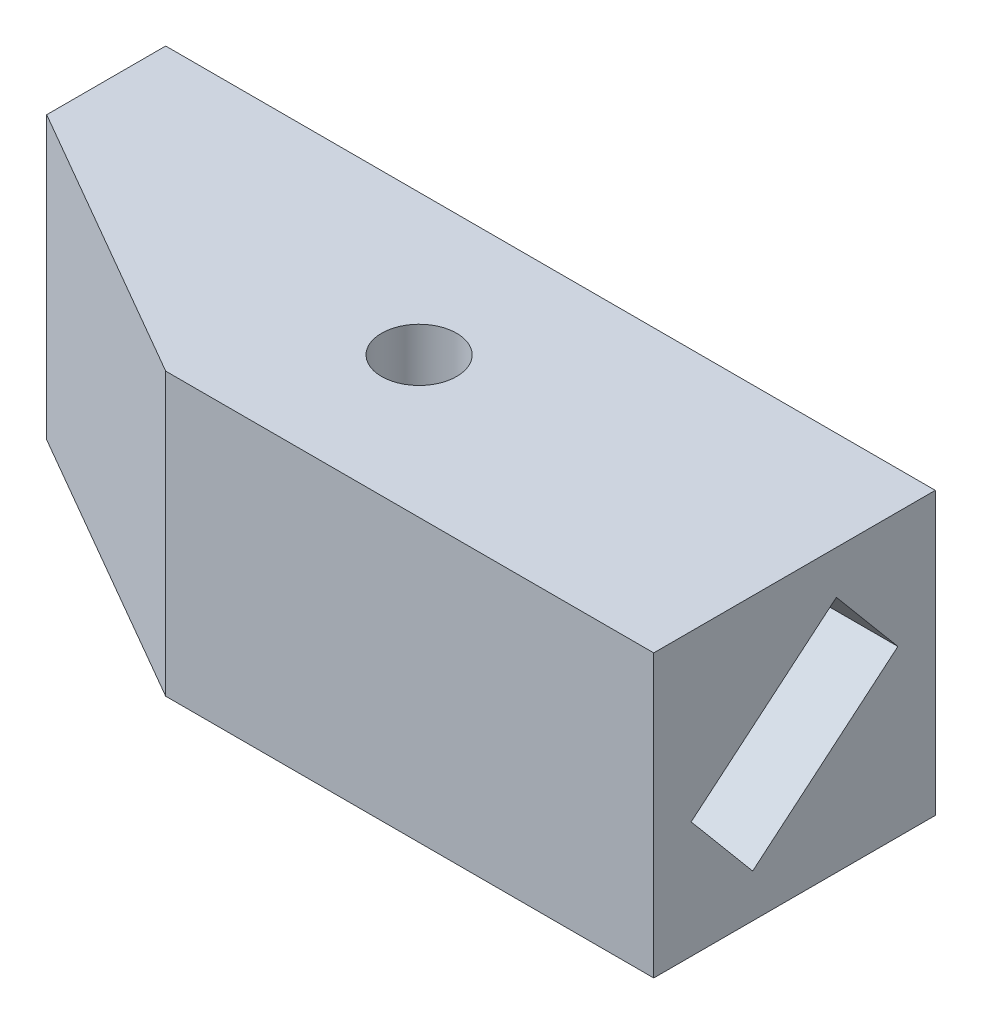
ISO-10303-21;
HEADER;
FILE_DESCRIPTION(('STEP AP214'),'2;1');
FILE_NAME('part.step','',(''),(''),'','','');
FILE_SCHEMA(('AUTOMOTIVE_DESIGN { 1 0 10303 214 1 1 1 1 }'));
ENDSEC;
DATA;
#1=APPLICATION_CONTEXT('core data for automotive mechanical design processes');
#2=APPLICATION_PROTOCOL_DEFINITION('international standard','automotive_design',2000,#1);
#3=PRODUCT_CONTEXT('',#1,'mechanical');
#4=PRODUCT('Part','Part','',(#3));
#5=PRODUCT_RELATED_PRODUCT_CATEGORY('part','',(#4));
#6=PRODUCT_DEFINITION_FORMATION('','',#4);
#7=PRODUCT_DEFINITION_CONTEXT('part definition',#1,'design');
#8=PRODUCT_DEFINITION('design','',#6,#7);
#9=PRODUCT_DEFINITION_SHAPE('','',#8);
#10=(LENGTH_UNIT() NAMED_UNIT(*) SI_UNIT(.MILLI.,.METRE.));
#11=(NAMED_UNIT(*) PLANE_ANGLE_UNIT() SI_UNIT($,.RADIAN.));
#12=(NAMED_UNIT(*) SI_UNIT($,.STERADIAN.) SOLID_ANGLE_UNIT());
#13=UNCERTAINTY_MEASURE_WITH_UNIT(LENGTH_MEASURE(1.E-05),#10,'distance_accuracy_value','');
#14=(GEOMETRIC_REPRESENTATION_CONTEXT(3) GLOBAL_UNCERTAINTY_ASSIGNED_CONTEXT((#13)) GLOBAL_UNIT_ASSIGNED_CONTEXT((#10,
#11,#12)) REPRESENTATION_CONTEXT('',''));
#15=CARTESIAN_POINT('',(0.,0.,0.));
#16=DIRECTION('',(0.,0.,1.));
#17=DIRECTION('',(1.,0.,0.));
#18=AXIS2_PLACEMENT_3D('',#15,#16,#17);
#19=CARTESIAN_POINT('',(20.,30.,15.));
#20=DIRECTION('',(-1.,0.,0.));
#21=DIRECTION('',(0.,0.,1.));
#22=AXIS2_PLACEMENT_3D('',#19,#20,#21);
#23=PLANE('',#22);
#24=DIRECTION('',(0.,-0.766044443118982,-0.642787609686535));
#25=VECTOR('',#24,1.);
#26=CARTESIAN_POINT('',(20.,4.60101848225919,4.45883206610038));
#27=LINE('',#26,#25);
#28=CARTESIAN_POINT('',(20.,12.4146718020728,11.015265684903));
#29=VERTEX_POINT('',#28);
#30=CARTESIAN_POINT('',(20.,4.60101848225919,4.45883206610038));
#31=VERTEX_POINT('',#30);
#32=EDGE_CURVE('E145',#29,#31,#27,.T.);
#33=ORIENTED_EDGE('',*,*,#32,.F.);
#34=DIRECTION('',(0.,-0.642787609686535,0.766044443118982));
#35=VECTOR('',#34,1.);
#36=CARTESIAN_POINT('',(20.,25.3989815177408,-4.45883206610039));
#37=LINE('',#36,#35);
#38=CARTESIAN_POINT('',(20.,25.3989815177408,-4.45883206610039));
#39=VERTEX_POINT('',#38);
#40=EDGE_CURVE('E127',#39,#29,#37,.T.);
#41=ORIENTED_EDGE('',*,*,#40,.F.);
#42=DIRECTION('',(0.,0.766044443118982,0.642787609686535));
#43=VECTOR('',#42,1.);
#44=CARTESIAN_POINT('',(20.,17.5853281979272,-11.015265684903));
#45=LINE('',#44,#43);
#46=CARTESIAN_POINT('',(20.,17.5853281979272,-11.015265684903));
#47=VERTEX_POINT('',#46);
#48=EDGE_CURVE('E134',#47,#39,#45,.T.);
#49=ORIENTED_EDGE('',*,*,#48,.F.);
#50=DIRECTION('',(0.,0.642787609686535,-0.766044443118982));
#51=VECTOR('',#50,1.);
#52=CARTESIAN_POINT('',(20.,17.5853281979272,-11.015265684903));
#53=LINE('',#52,#51);
#54=EDGE_CURVE('E148',#31,#47,#53,.T.);
#55=ORIENTED_EDGE('',*,*,#54,.F.);
#56=EDGE_LOOP('',(#33,#41,#49,#55));
#57=FACE_BOUND('',#56,.T.);
#58=DIRECTION('',(0.,0.,-1.));
#59=VECTOR('',#58,1.);
#60=CARTESIAN_POINT('',(20.,0.,15.));
#61=LINE('',#60,#59);
#62=CARTESIAN_POINT('',(20.,0.,15.));
#63=VERTEX_POINT('',#62);
#64=CARTESIAN_POINT('',(20.,0.,-15.));
#65=VERTEX_POINT('',#64);
#66=EDGE_CURVE('E165',#63,#65,#61,.T.);
#67=ORIENTED_EDGE('',*,*,#66,.T.);
#68=DIRECTION('',(0.,-1.,0.));
#69=VECTOR('',#68,1.);
#70=CARTESIAN_POINT('',(20.,30.,-15.));
#71=LINE('',#70,#69);
#72=CARTESIAN_POINT('',(20.,30.,-15.));
#73=VERTEX_POINT('',#72);
#74=EDGE_CURVE('E178',#73,#65,#71,.T.);
#75=ORIENTED_EDGE('',*,*,#74,.F.);
#76=DIRECTION('',(0.,0.,-1.));
#77=VECTOR('',#76,1.);
#78=CARTESIAN_POINT('',(20.,30.,15.));
#79=LINE('',#78,#77);
#80=CARTESIAN_POINT('',(20.,30.,15.));
#81=VERTEX_POINT('',#80);
#82=EDGE_CURVE('E117',#81,#73,#79,.T.);
#83=ORIENTED_EDGE('',*,*,#82,.F.);
#84=DIRECTION('',(0.,-1.,0.));
#85=VECTOR('',#84,1.);
#86=CARTESIAN_POINT('',(20.,30.,15.));
#87=LINE('',#86,#85);
#88=EDGE_CURVE('E171',#81,#63,#87,.T.);
#89=ORIENTED_EDGE('',*,*,#88,.T.);
#90=EDGE_LOOP('',(#67,#75,#83,#89));
#91=FACE_BOUND('',#90,.T.);
#92=ADVANCED_FACE('F34',(#57,#91),#23,.F.);
#93=CARTESIAN_POINT('',(-20.,30.,-15.));
#94=DIRECTION('',(0.,0.,1.));
#95=DIRECTION('',(1.,0.,0.));
#96=AXIS2_PLACEMENT_3D('',#93,#94,#95);
#97=PLANE('',#96);
#98=DIRECTION('',(-1.,0.,0.));
#99=VECTOR('',#98,1.);
#100=CARTESIAN_POINT('',(-20.,0.,-15.));
#101=LINE('',#100,#99);
#102=CARTESIAN_POINT('',(-62.,0.,-15.));
#103=VERTEX_POINT('',#102);
#104=EDGE_CURVE('E124',#65,#103,#101,.T.);
#105=ORIENTED_EDGE('',*,*,#104,.T.);
#106=DIRECTION('',(0.,-1.,0.));
#107=VECTOR('',#106,1.);
#108=CARTESIAN_POINT('',(-62.,0.,-15.));
#109=LINE('',#108,#107);
#110=CARTESIAN_POINT('',(-62.,30.,-15.));
#111=VERTEX_POINT('',#110);
#112=EDGE_CURVE('E108',#111,#103,#109,.T.);
#113=ORIENTED_EDGE('',*,*,#112,.F.);
#114=DIRECTION('',(-1.,0.,0.));
#115=VECTOR('',#114,1.);
#116=CARTESIAN_POINT('',(-20.,30.,-15.));
#117=LINE('',#116,#115);
#118=EDGE_CURVE('E114',#73,#111,#117,.T.);
#119=ORIENTED_EDGE('',*,*,#118,.F.);
#120=ORIENTED_EDGE('',*,*,#74,.T.);
#121=EDGE_LOOP('',(#105,#113,#119,#120));
#122=FACE_BOUND('',#121,.T.);
#123=ADVANCED_FACE('F123',(#122),#97,.F.);
#124=CARTESIAN_POINT('',(-20.,30.,15.));
#125=DIRECTION('',(0.,0.,-1.));
#126=DIRECTION('',(-1.,0.,0.));
#127=AXIS2_PLACEMENT_3D('',#124,#125,#126);
#128=PLANE('',#127);
#129=DIRECTION('',(1.,0.,0.));
#130=VECTOR('',#129,1.);
#131=CARTESIAN_POINT('',(-35.,30.,15.));
#132=LINE('',#131,#130);
#133=CARTESIAN_POINT('',(-31.9999999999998,30.,15.));
#134=VERTEX_POINT('',#133);
#135=EDGE_CURVE('E121',#134,#81,#132,.T.);
#136=ORIENTED_EDGE('',*,*,#135,.F.);
#137=DIRECTION('',(0.,-1.,0.));
#138=VECTOR('',#137,1.);
#139=CARTESIAN_POINT('',(-31.9999999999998,30.,15.));
#140=LINE('',#139,#138);
#141=CARTESIAN_POINT('',(-31.9999999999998,0.,15.));
#142=VERTEX_POINT('',#141);
#143=EDGE_CURVE('E42',#134,#142,#140,.T.);
#144=ORIENTED_EDGE('',*,*,#143,.T.);
#145=DIRECTION('',(1.,0.,0.));
#146=VECTOR('',#145,1.);
#147=CARTESIAN_POINT('',(-20.,0.,15.));
#148=LINE('',#147,#146);
#149=EDGE_CURVE('E168',#142,#63,#148,.T.);
#150=ORIENTED_EDGE('',*,*,#149,.T.);
#151=ORIENTED_EDGE('',*,*,#88,.F.);
#152=EDGE_LOOP('',(#136,#144,#150,#151));
#153=FACE_BOUND('',#152,.T.);
#154=ADVANCED_FACE('F199',(#153),#128,.F.);
#155=CARTESIAN_POINT('',(0.,30.,0.));
#156=DIRECTION('',(0.,-1.,0.));
#157=DIRECTION('',(0.,0.,-1.));
#158=AXIS2_PLACEMENT_3D('',#155,#156,#157);
#159=PLANE('',#158);
#160=CARTESIAN_POINT('',(-20.,30.,0.));
#161=DIRECTION('',(0.,1.,0.));
#162=DIRECTION('',(0.,0.,1.));
#163=AXIS2_PLACEMENT_3D('',#160,#161,#162);
#164=CIRCLE('',#163,4.);
#165=CARTESIAN_POINT('',(-20.,30.,4.));
#166=VERTEX_POINT('',#165);
#167=EDGE_CURVE('E155',#166,#166,#164,.T.);
#168=ORIENTED_EDGE('',*,*,#167,.F.);
#169=EDGE_LOOP('',(#168));
#170=FACE_BOUND('',#169,.T.);
#171=DIRECTION('',(0.,0.,-1.));
#172=VECTOR('',#171,1.);
#173=CARTESIAN_POINT('',(-62.,30.,-15.));
#174=LINE('',#173,#172);
#175=CARTESIAN_POINT('',(-62.,30.,-2.32050807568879));
#176=VERTEX_POINT('',#175);
#177=EDGE_CURVE('E103',#176,#111,#174,.T.);
#178=ORIENTED_EDGE('',*,*,#177,.F.);
#179=DIRECTION('',(-0.86602540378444,0.,-0.499999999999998));
#180=VECTOR('',#179,1.);
#181=CARTESIAN_POINT('',(-62.,30.,-2.32050807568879));
#182=LINE('',#181,#180);
#183=EDGE_CURVE('E56',#176,#134,#182,.F.);
#184=ORIENTED_EDGE('',*,*,#183,.T.);
#185=ORIENTED_EDGE('',*,*,#135,.T.);
#186=ORIENTED_EDGE('',*,*,#82,.T.);
#187=ORIENTED_EDGE('',*,*,#118,.T.);
#188=EDGE_LOOP('',(#178,#184,#185,#186,#187));
#189=FACE_BOUND('',#188,.T.);
#190=ADVANCED_FACE('F115',(#170,#189),#159,.F.);
#191=CARTESIAN_POINT('',(0.,0.,0.));
#192=DIRECTION('',(0.,-1.,0.));
#193=DIRECTION('',(0.,0.,-1.));
#194=AXIS2_PLACEMENT_3D('',#191,#192,#193);
#195=PLANE('',#194);
#196=CARTESIAN_POINT('',(-20.,0.,0.));
#197=DIRECTION('',(0.,1.,0.));
#198=DIRECTION('',(0.,0.,1.));
#199=AXIS2_PLACEMENT_3D('',#196,#197,#198);
#200=CIRCLE('',#199,4.);
#201=CARTESIAN_POINT('',(-20.,0.,4.));
#202=VERTEX_POINT('',#201);
#203=EDGE_CURVE('E162',#202,#202,#200,.T.);
#204=ORIENTED_EDGE('',*,*,#203,.T.);
#205=EDGE_LOOP('',(#204));
#206=FACE_BOUND('',#205,.T.);
#207=ORIENTED_EDGE('',*,*,#149,.F.);
#208=DIRECTION('',(0.86602540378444,0.,0.499999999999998));
#209=VECTOR('',#208,1.);
#210=CARTESIAN_POINT('',(-14.4951905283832,0.,25.1064064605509));
#211=LINE('',#210,#209);
#212=CARTESIAN_POINT('',(-62.,0.,-2.32050807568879));
#213=VERTEX_POINT('',#212);
#214=EDGE_CURVE('E11',#142,#213,#211,.F.);
#215=ORIENTED_EDGE('',*,*,#214,.T.);
#216=DIRECTION('',(0.,0.,1.));
#217=VECTOR('',#216,1.);
#218=CARTESIAN_POINT('',(-62.,0.,-15.));
#219=LINE('',#218,#217);
#220=EDGE_CURVE('E125',#103,#213,#219,.T.);
#221=ORIENTED_EDGE('',*,*,#220,.F.);
#222=ORIENTED_EDGE('',*,*,#104,.F.);
#223=ORIENTED_EDGE('',*,*,#66,.F.);
#224=EDGE_LOOP('',(#207,#215,#221,#222,#223));
#225=FACE_BOUND('',#224,.T.);
#226=ADVANCED_FACE('F185',(#206,#225),#195,.T.);
#227=CARTESIAN_POINT('',(-20.,0.,0.));
#228=DIRECTION('',(0.,1.,0.));
#229=DIRECTION('',(0.,0.,1.));
#230=AXIS2_PLACEMENT_3D('',#227,#228,#229);
#231=CYLINDRICAL_SURFACE('',#230,4.);
#232=ORIENTED_EDGE('',*,*,#203,.F.);
#233=EDGE_LOOP('',(#232));
#234=FACE_BOUND('',#233,.T.);
#235=ORIENTED_EDGE('',*,*,#167,.T.);
#236=EDGE_LOOP('',(#235));
#237=FACE_BOUND('',#236,.T.);
#238=ADVANCED_FACE('F207',(#234,#237),#231,.F.);
#239=CARTESIAN_POINT('',(-10.,25.3989815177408,-4.45883206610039));
#240=DIRECTION('',(0.,0.766044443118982,0.642787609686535));
#241=DIRECTION('',(0.,-0.642787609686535,0.766044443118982));
#242=AXIS2_PLACEMENT_3D('',#239,#240,#241);
#243=PLANE('',#242);
#244=ORIENTED_EDGE('',*,*,#40,.T.);
#245=DIRECTION('',(1.,0.,0.));
#246=VECTOR('',#245,1.);
#247=CARTESIAN_POINT('',(-10.,12.4146718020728,11.015265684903));
#248=LINE('',#247,#246);
#249=CARTESIAN_POINT('',(-10.,12.4146718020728,11.015265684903));
#250=VERTEX_POINT('',#249);
#251=EDGE_CURVE('E143',#250,#29,#248,.T.);
#252=ORIENTED_EDGE('',*,*,#251,.F.);
#253=DIRECTION('',(0.,-0.642787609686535,0.766044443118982));
#254=VECTOR('',#253,1.);
#255=CARTESIAN_POINT('',(-10.,25.3989815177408,-4.45883206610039));
#256=LINE('',#255,#254);
#257=CARTESIAN_POINT('',(-10.,25.3989815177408,-4.45883206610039));
#258=VERTEX_POINT('',#257);
#259=EDGE_CURVE('E130',#258,#250,#256,.T.);
#260=ORIENTED_EDGE('',*,*,#259,.F.);
#261=DIRECTION('',(1.,0.,0.));
#262=VECTOR('',#261,1.);
#263=CARTESIAN_POINT('',(-10.,25.3989815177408,-4.45883206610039));
#264=LINE('',#263,#262);
#265=EDGE_CURVE('E153',#258,#39,#264,.T.);
#266=ORIENTED_EDGE('',*,*,#265,.T.);
#267=EDGE_LOOP('',(#244,#252,#260,#266));
#268=FACE_BOUND('',#267,.T.);
#269=ADVANCED_FACE('F214',(#268),#243,.F.);
#270=CARTESIAN_POINT('',(-10.,17.5853281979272,-11.015265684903));
#271=DIRECTION('',(0.,0.642787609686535,-0.766044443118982));
#272=DIRECTION('',(0.,0.766044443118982,0.642787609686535));
#273=AXIS2_PLACEMENT_3D('',#270,#271,#272);
#274=PLANE('',#273);
#275=ORIENTED_EDGE('',*,*,#48,.T.);
#276=ORIENTED_EDGE('',*,*,#265,.F.);
#277=DIRECTION('',(0.,0.766044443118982,0.642787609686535));
#278=VECTOR('',#277,1.);
#279=CARTESIAN_POINT('',(-10.,17.5853281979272,-11.015265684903));
#280=LINE('',#279,#278);
#281=CARTESIAN_POINT('',(-10.,17.5853281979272,-11.015265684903));
#282=VERTEX_POINT('',#281);
#283=EDGE_CURVE('E140',#282,#258,#280,.T.);
#284=ORIENTED_EDGE('',*,*,#283,.F.);
#285=DIRECTION('',(1.,0.,0.));
#286=VECTOR('',#285,1.);
#287=CARTESIAN_POINT('',(-10.,17.5853281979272,-11.015265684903));
#288=LINE('',#287,#286);
#289=EDGE_CURVE('E156',#282,#47,#288,.T.);
#290=ORIENTED_EDGE('',*,*,#289,.T.);
#291=EDGE_LOOP('',(#275,#276,#284,#290));
#292=FACE_BOUND('',#291,.T.);
#293=ADVANCED_FACE('F218',(#292),#274,.F.);
#294=CARTESIAN_POINT('',(-10.,17.5853281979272,-11.015265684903));
#295=DIRECTION('',(0.,-0.766044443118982,-0.642787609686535));
#296=DIRECTION('',(0.,0.642787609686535,-0.766044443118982));
#297=AXIS2_PLACEMENT_3D('',#294,#295,#296);
#298=PLANE('',#297);
#299=ORIENTED_EDGE('',*,*,#54,.T.);
#300=ORIENTED_EDGE('',*,*,#289,.F.);
#301=DIRECTION('',(0.,0.642787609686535,-0.766044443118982));
#302=VECTOR('',#301,1.);
#303=CARTESIAN_POINT('',(-10.,17.5853281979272,-11.015265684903));
#304=LINE('',#303,#302);
#305=CARTESIAN_POINT('',(-10.,4.60101848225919,4.45883206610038));
#306=VERTEX_POINT('',#305);
#307=EDGE_CURVE('E137',#306,#282,#304,.T.);
#308=ORIENTED_EDGE('',*,*,#307,.F.);
#309=DIRECTION('',(1.,0.,0.));
#310=VECTOR('',#309,1.);
#311=CARTESIAN_POINT('',(-10.,4.60101848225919,4.45883206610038));
#312=LINE('',#311,#310);
#313=EDGE_CURVE('E158',#306,#31,#312,.T.);
#314=ORIENTED_EDGE('',*,*,#313,.T.);
#315=EDGE_LOOP('',(#299,#300,#308,#314));
#316=FACE_BOUND('',#315,.T.);
#317=ADVANCED_FACE('F223',(#316),#298,.F.);
#318=CARTESIAN_POINT('',(-10.,4.60101848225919,4.45883206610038));
#319=DIRECTION('',(0.,-0.642787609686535,0.766044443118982));
#320=DIRECTION('',(0.,-0.766044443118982,-0.642787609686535));
#321=AXIS2_PLACEMENT_3D('',#318,#319,#320);
#322=PLANE('',#321);
#323=ORIENTED_EDGE('',*,*,#32,.T.);
#324=ORIENTED_EDGE('',*,*,#313,.F.);
#325=DIRECTION('',(0.,-0.766044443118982,-0.642787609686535));
#326=VECTOR('',#325,1.);
#327=CARTESIAN_POINT('',(-10.,4.60101848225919,4.45883206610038));
#328=LINE('',#327,#326);
#329=EDGE_CURVE('E133',#250,#306,#328,.T.);
#330=ORIENTED_EDGE('',*,*,#329,.F.);
#331=ORIENTED_EDGE('',*,*,#251,.T.);
#332=EDGE_LOOP('',(#323,#324,#330,#331));
#333=FACE_BOUND('',#332,.T.);
#334=ADVANCED_FACE('F220',(#333),#322,.F.);
#335=CARTESIAN_POINT('',(-10.,0.,0.));
#336=DIRECTION('',(-1.,0.,0.));
#337=DIRECTION('',(0.,0.,1.));
#338=AXIS2_PLACEMENT_3D('',#335,#336,#337);
#339=PLANE('',#338);
#340=ORIENTED_EDGE('',*,*,#259,.T.);
#341=ORIENTED_EDGE('',*,*,#329,.T.);
#342=ORIENTED_EDGE('',*,*,#307,.T.);
#343=ORIENTED_EDGE('',*,*,#283,.T.);
#344=EDGE_LOOP('',(#340,#341,#342,#343));
#345=FACE_BOUND('',#344,.T.);
#346=ADVANCED_FACE('F192',(#345),#339,.F.);
#347=CARTESIAN_POINT('',(-62.,0.,0.));
#348=DIRECTION('',(1.,0.,0.));
#349=DIRECTION('',(0.,0.,-1.));
#350=AXIS2_PLACEMENT_3D('',#347,#348,#349);
#351=PLANE('',#350);
#352=ORIENTED_EDGE('',*,*,#220,.T.);
#353=DIRECTION('',(0.,1.,0.));
#354=VECTOR('',#353,1.);
#355=CARTESIAN_POINT('',(-62.,0.,-2.32050807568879));
#356=LINE('',#355,#354);
#357=EDGE_CURVE('E111',#213,#176,#356,.T.);
#358=ORIENTED_EDGE('',*,*,#357,.T.);
#359=ORIENTED_EDGE('',*,*,#177,.T.);
#360=ORIENTED_EDGE('',*,*,#112,.T.);
#361=EDGE_LOOP('',(#352,#358,#359,#360));
#362=FACE_BOUND('',#361,.T.);
#363=ADVANCED_FACE('F106',(#362),#351,.F.);
#364=CARTESIAN_POINT('',(-62.,0.,-2.32050807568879));
#365=DIRECTION('',(0.499999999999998,0.,-0.86602540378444));
#366=DIRECTION('',(0.,1.,0.));
#367=AXIS2_PLACEMENT_3D('',#364,#365,#366);
#368=PLANE('',#367);
#369=ORIENTED_EDGE('',*,*,#214,.F.);
#370=ORIENTED_EDGE('',*,*,#143,.F.);
#371=ORIENTED_EDGE('',*,*,#183,.F.);
#372=ORIENTED_EDGE('',*,*,#357,.F.);
#373=EDGE_LOOP('',(#369,#370,#371,#372));
#374=FACE_BOUND('',#373,.T.);
#375=ADVANCED_FACE('F36',(#374),#368,.F.);
#376=CLOSED_SHELL('',(#92,#123,#154,#190,#226,#238,#269,#293,#317,#334,#346,#363,#375));
#377=MANIFOLD_SOLID_BREP('B2',#376);
#378=ADVANCED_BREP_SHAPE_REPRESENTATION('',(#18,#377),#14);
#379=SHAPE_DEFINITION_REPRESENTATION(#9,#378);
ENDSEC;
END-ISO-10303-21;
